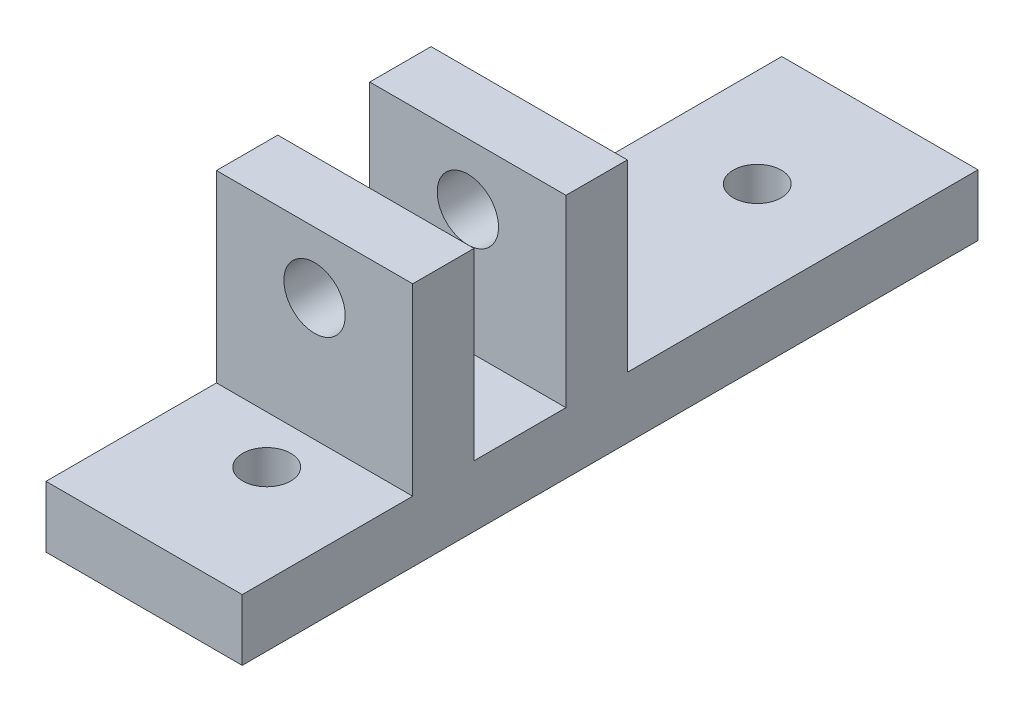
from build123d import *

# Parameters (mm, degrees)
SKETCH1_W           = 20.32
SKETCH1_H           = 25.4
BOSS_EXTRUDE1_DEPTH = 76.2
SKETCH2_W           = 20.32
SKETCH2_H           = 87.122
SKETCH2_H_2         = 9.525
SKETCH2_H_3         = 17.653
CUT_EXTRUDE1_DEPTH  = 19.05
SKETCH3_R           = 3.175
CUT_EXTRUDE2_DEPTH  = 67.976216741
SKETCH4_R           = 2.4892
CUT_EXTRUDE3_DEPTH  = 19.05


with BuildPart() as part:
    # Sketch1 → Boss-Extrude1 (new body)
    with BuildSketch(Plane.XY):
        with Locations((10.16, 12.7)):
            Rectangle(SKETCH1_W, SKETCH1_H)
    extrude(amount=BOSS_EXTRUDE1_DEPTH)

    # Sketch2 → Cut-Extrude1 (cut)
    with BuildSketch(Plane(origin=(0, 25.4, 0), x_dir=(1, 0, 0), z_dir=(0, 1, 0))):
        with Locations((10.16, 7.239)):
            Rectangle(SKETCH2_W, SKETCH2_H)
        with Locations((10.16, -47.4345)):
            Rectangle(SKETCH2_W, SKETCH2_H_2)
        with Locations((10.16, -67.3735)):
            Rectangle(SKETCH2_W, SKETCH2_H_3)
    extrude(amount=-CUT_EXTRUDE1_DEPTH, mode=Mode.SUBTRACT)

    # Sketch3 → Cut-Extrude2 (cut, through all)
    with BuildSketch(Plane.XY.offset(58.547)):
        with Locations((10.16, 19.05)):
            Circle(SKETCH3_R)
    extrude(amount=-CUT_EXTRUDE2_DEPTH, mode=Mode.SUBTRACT)

    # Sketch4 → Cut-Extrude3 (cut)
    with BuildSketch(Plane.XZ):
        with Locations(Location((10.16, 63.5, 0), (0, 0, 270))):
            Circle(SKETCH4_R)
        with Locations(Location((10.16, 12.7, 0), (0, 0, 270))):
            Circle(SKETCH4_R)
    extrude(amount=-CUT_EXTRUDE3_DEPTH, mode=Mode.SUBTRACT)


solid = part.part
